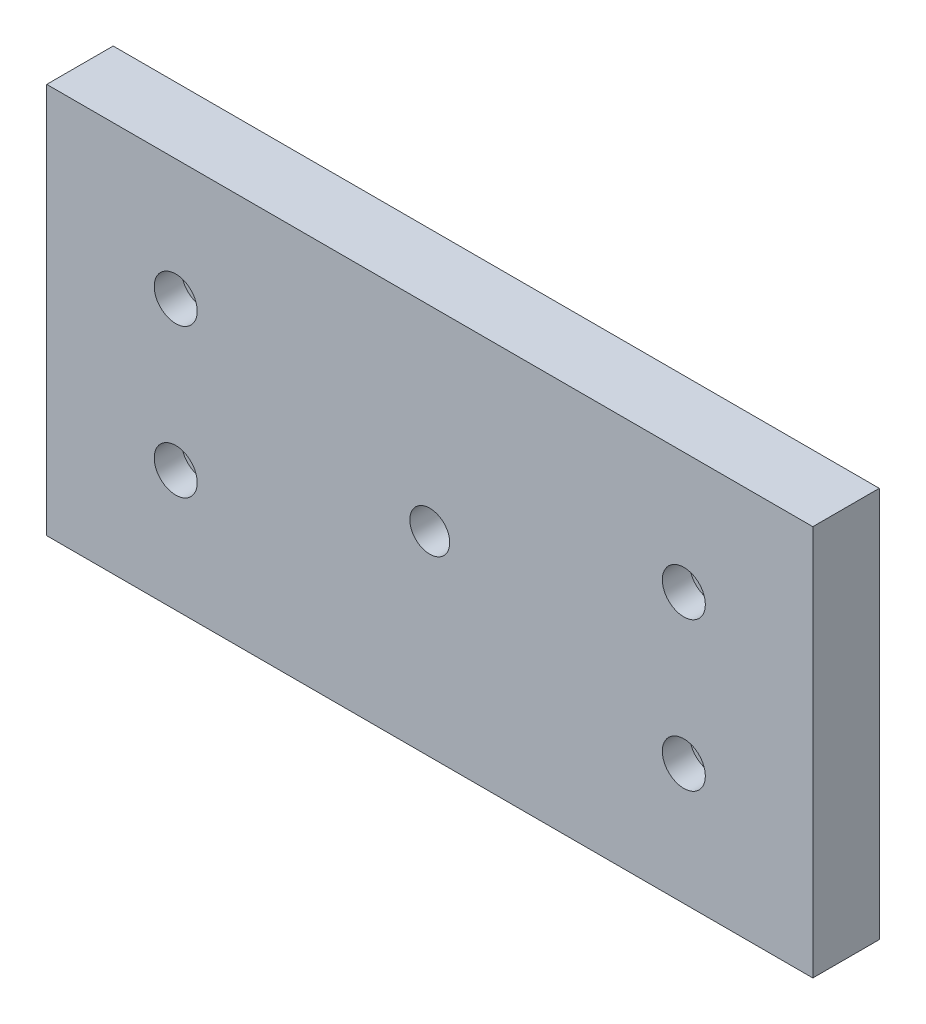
from build123d import *

# Parameters (mm, degrees)
ESQUISSE1_W                                        = 196
ESQUISSE1_H                                        = 100
EXTRUSION1_DEPTH                                   = 17
TROU_TARAUD_M12X1_751_D                            = 10.2
TROU_TARAUD_M12X1_751_DEPTH                        = 13.25
TROU_TARAUD_M12X1_751_TIP                          = 3.064389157
CHAMBRAGE_POUR_VIS_T_TE_HEXAGONALE_M62_D           = 6.6
CHAMBRAGE_POUR_VIS_T_TE_HEXAGONALE_M62_CBORE_D     = 11
CHAMBRAGE_POUR_VIS_T_TE_HEXAGONALE_M62_CBORE_DEPTH = 7


with BuildPart() as part:
    # Esquisse1 → Extrusion1 (new body)
    with BuildSketch(Plane.XY):
        with Locations((98, 50)):
            Rectangle(ESQUISSE1_W, ESQUISSE1_H)
    extrude(amount=EXTRUSION1_DEPTH)

    # Trou taraud_ M12x1.751
    with Locations(Plane(origin=(98, 50, 17), x_dir=(1, 0, 0), z_dir=(0, 0, 1))):
        with Locations((0, 0)):
            Hole(TROU_TARAUD_M12X1_751_D / 2, depth=TROU_TARAUD_M12X1_751_DEPTH)
            with Locations((0, 0, -(TROU_TARAUD_M12X1_751_DEPTH + TROU_TARAUD_M12X1_751_TIP / 2))):  # 118° drill point
                Cone(0, TROU_TARAUD_M12X1_751_D / 2, TROU_TARAUD_M12X1_751_TIP, mode=Mode.SUBTRACT)

    # Chambrage pour vis _ t_te hexagonale M62 (through all)
    with Locations(Plane.XY.offset(17)):
        with Locations((33, 69), (163, 69), (33, 31), (163, 31)):
            CounterBoreHole(CHAMBRAGE_POUR_VIS_T_TE_HEXAGONALE_M62_D / 2, CHAMBRAGE_POUR_VIS_T_TE_HEXAGONALE_M62_CBORE_D / 2, CHAMBRAGE_POUR_VIS_T_TE_HEXAGONALE_M62_CBORE_DEPTH)


solid = part.part
